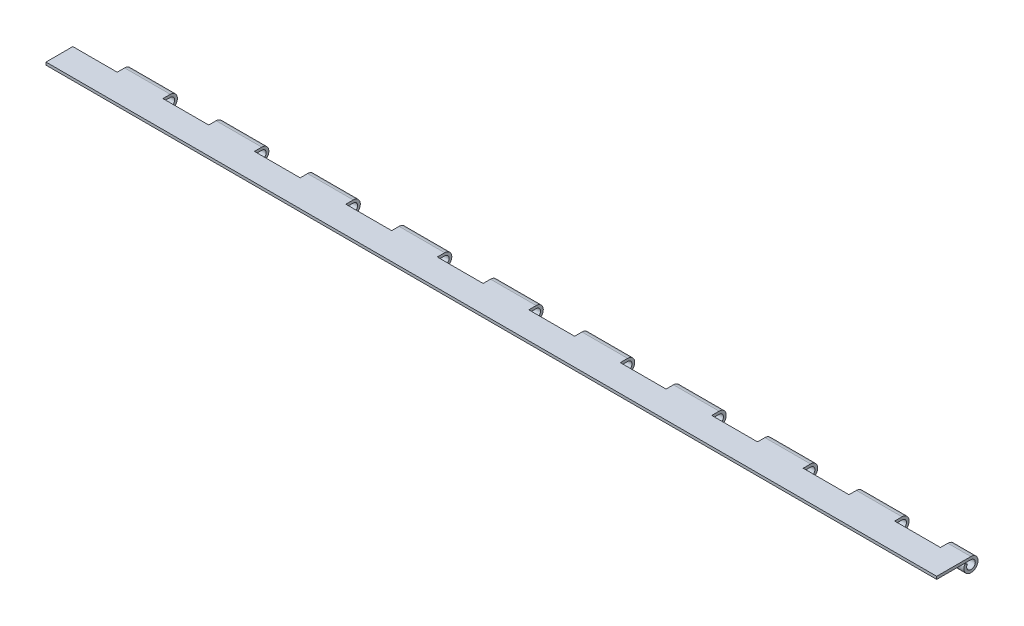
from build123d import *

# Parameters (mm, degrees)
EXTRUDE1_DEPTH     = 1219.2
SKETCH2_W          = 50.927
SKETCH2_H          = 24.426126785
CUT_EXTRUDE1_DEPTH = 1220.895699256
SKETCH3_W          = 250.795613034
SKETCH3_H          = 113.876505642
CUT_EXTRUDE2_DEPTH = 1220.895699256


with BuildPart() as part:
    # Sketch1 → Extrude1 (new body)
    with BuildSketch(Plane(origin=(0, 0, 0), x_dir=(0, 0, -1), z_dir=(1, 0, 0))):
        with BuildLine():
            Line((-4.094609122, 2.471134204), (-6.704198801, 4.046045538))
            ThreePointArc((-6.704198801, 4.046045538), (3.849298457, -6.819066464), (0, 7.830502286))
            Line((0, 7.830502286), (-38.1, 7.830502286))
            Line((-38.1, 7.830502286), (-38.1, 4.782502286))
            Line((-38.1, 4.782502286), (-6.200357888, 4.782502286))
            Line((-6.200357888, 4.782502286), (0, 4.782502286))
            ThreePointArc((0, 4.782502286), (2.350970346, -4.164764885), (-4.094609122, 2.471134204))
        make_face()
    extrude(amount=EXTRUDE1_DEPTH)

    # Sketch2 → Cut-Extrude1 (cut, through all)
    with BuildSketch(Plane(origin=(0, 7.830502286, 0), x_dir=(1, 0, 0), z_dir=(0, 1, 0))):
        with Locations((1142.9365, 3.934324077)):
            Rectangle(SKETCH2_W, SKETCH2_H)
        with Locations((1041.2095, 3.934324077)):
            Rectangle(SKETCH2_W, SKETCH2_H)
        with Locations((939.4825, 3.934324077)):
            Rectangle(SKETCH2_W, SKETCH2_H)
        with Locations((837.7555, 3.934324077)):
            Rectangle(SKETCH2_W, SKETCH2_H)
        with Locations((736.0285, 3.934324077)):
            Rectangle(SKETCH2_W, SKETCH2_H)
        with Locations((634.3015, 3.934324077)):
            Rectangle(SKETCH2_W, SKETCH2_H)
        with Locations((532.5745, 3.934324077)):
            Rectangle(SKETCH2_W, SKETCH2_H)
        with Locations((430.8475, 3.934324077)):
            Rectangle(SKETCH2_W, SKETCH2_H)
        with Locations((329.1205, 3.934324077)):
            Rectangle(SKETCH2_W, SKETCH2_H)
        with Locations((227.3935, 3.934324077)):
            Rectangle(SKETCH2_W, SKETCH2_H)
        with Locations((125.6665, 3.934324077)):
            Rectangle(SKETCH2_W, SKETCH2_H)
        with Locations((23.9395, 3.934324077)):
            Rectangle(SKETCH2_W, SKETCH2_H)
    extrude(amount=-CUT_EXTRUDE1_DEPTH, mode=Mode.SUBTRACT)

    # Sketch3 → Cut-Extrude2 (cut, through all)
    with BuildSketch(Plane(origin=(0, 7.830502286, 0), x_dir=(1, 0, 0), z_dir=(0, 1, 0))):
        with Locations((1115.997806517, -20.974569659)):
            Rectangle(SKETCH3_W, SKETCH3_H)
    extrude(amount=-CUT_EXTRUDE2_DEPTH, mode=Mode.SUBTRACT)


solid = part.part
